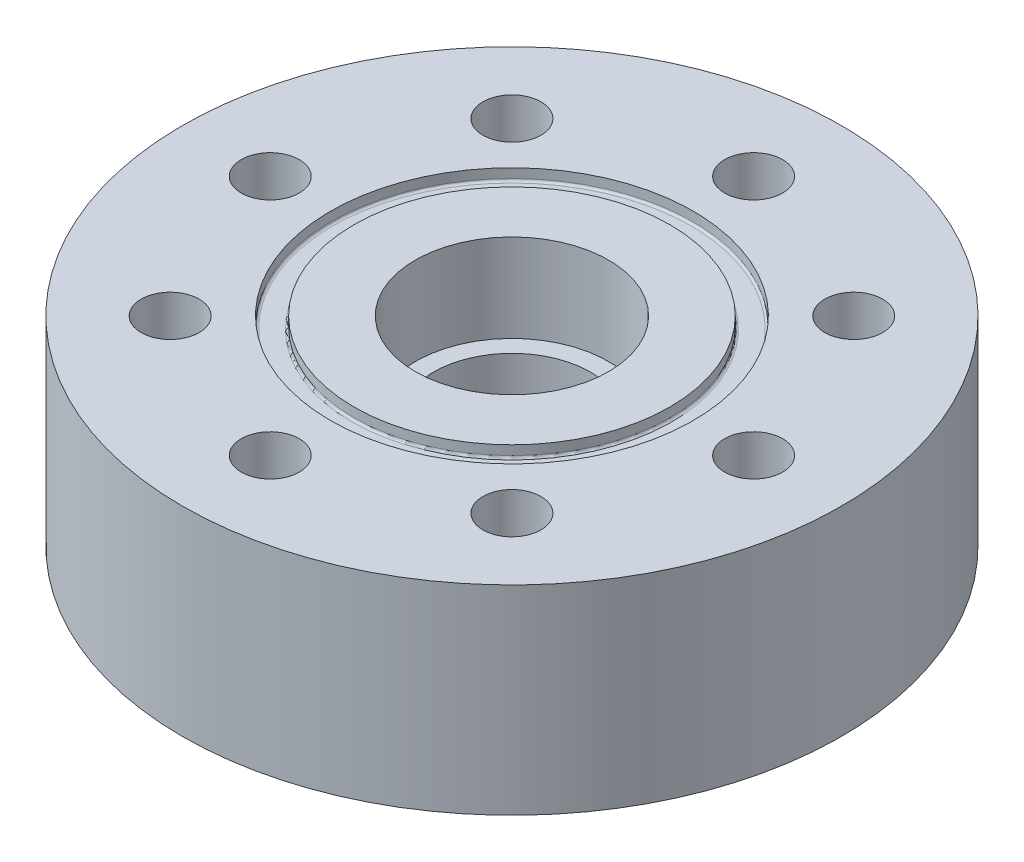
ISO-10303-21;
HEADER;
FILE_DESCRIPTION(('STEP AP214'),'2;1');
FILE_NAME('part.step','',(''),(''),'','','');
FILE_SCHEMA(('AUTOMOTIVE_DESIGN { 1 0 10303 214 1 1 1 1 }'));
ENDSEC;
DATA;
#1=APPLICATION_CONTEXT('core data for automotive mechanical design processes');
#2=APPLICATION_PROTOCOL_DEFINITION('international standard','automotive_design',2000,#1);
#3=PRODUCT_CONTEXT('',#1,'mechanical');
#4=PRODUCT('Part','Part','',(#3));
#5=PRODUCT_RELATED_PRODUCT_CATEGORY('part','',(#4));
#6=PRODUCT_DEFINITION_FORMATION('','',#4);
#7=PRODUCT_DEFINITION_CONTEXT('part definition',#1,'design');
#8=PRODUCT_DEFINITION('design','',#6,#7);
#9=PRODUCT_DEFINITION_SHAPE('','',#8);
#10=(LENGTH_UNIT() NAMED_UNIT(*) SI_UNIT(.MILLI.,.METRE.));
#11=(NAMED_UNIT(*) PLANE_ANGLE_UNIT() SI_UNIT($,.RADIAN.));
#12=(NAMED_UNIT(*) SI_UNIT($,.STERADIAN.) SOLID_ANGLE_UNIT());
#13=UNCERTAINTY_MEASURE_WITH_UNIT(LENGTH_MEASURE(1.E-05),#10,'distance_accuracy_value','');
#14=(GEOMETRIC_REPRESENTATION_CONTEXT(3) GLOBAL_UNCERTAINTY_ASSIGNED_CONTEXT((#13)) GLOBAL_UNIT_ASSIGNED_CONTEXT((#10,
#11,#12)) REPRESENTATION_CONTEXT('',''));
#15=CARTESIAN_POINT('',(0.,0.,0.));
#16=DIRECTION('',(0.,0.,1.));
#17=DIRECTION('',(1.,0.,0.));
#18=AXIS2_PLACEMENT_3D('',#15,#16,#17);
#19=CARTESIAN_POINT('',(0.,22.7,0.));
#20=DIRECTION('',(0.,-1.,0.));
#21=DIRECTION('',(0.,0.,-1.));
#22=AXIS2_PLACEMENT_3D('',#19,#20,#21);
#23=CYLINDRICAL_SURFACE('',#22,37.5);
#24=CARTESIAN_POINT('',(0.,22.7,0.));
#25=DIRECTION('',(0.,1.,0.));
#26=DIRECTION('',(0.,0.,1.));
#27=AXIS2_PLACEMENT_3D('',#24,#25,#26);
#28=CIRCLE('',#27,37.5);
#29=CARTESIAN_POINT('',(0.,22.7,37.5));
#30=VERTEX_POINT('',#29);
#31=EDGE_CURVE('E54',#30,#30,#28,.T.);
#32=ORIENTED_EDGE('',*,*,#31,.F.);
#33=EDGE_LOOP('',(#32));
#34=FACE_BOUND('',#33,.T.);
#35=CARTESIAN_POINT('',(0.,0.,0.));
#36=DIRECTION('',(0.,1.,0.));
#37=DIRECTION('',(0.,0.,1.));
#38=AXIS2_PLACEMENT_3D('',#35,#36,#37);
#39=CIRCLE('',#38,37.5);
#40=CARTESIAN_POINT('',(0.,0.,37.5));
#41=VERTEX_POINT('',#40);
#42=EDGE_CURVE('E55',#41,#41,#39,.T.);
#43=ORIENTED_EDGE('',*,*,#42,.T.);
#44=EDGE_LOOP('',(#43));
#45=FACE_BOUND('',#44,.T.);
#46=ADVANCED_FACE('F34',(#34,#45),#23,.T.);
#47=CARTESIAN_POINT('',(0.,22.7,0.));
#48=DIRECTION('',(0.,1.,0.));
#49=DIRECTION('',(0.,0.,1.));
#50=AXIS2_PLACEMENT_3D('',#47,#48,#49);
#51=PLANE('',#50);
#52=CARTESIAN_POINT('',(0.,22.7,0.));
#53=DIRECTION('',(0.,1.,0.));
#54=DIRECTION('',(0.,0.,1.));
#55=AXIS2_PLACEMENT_3D('',#52,#53,#54);
#56=CIRCLE('',#55,20.6375);
#57=CARTESIAN_POINT('',(0.,22.7,20.6375));
#58=VERTEX_POINT('',#57);
#59=EDGE_CURVE('E73',#58,#58,#56,.T.);
#60=ORIENTED_EDGE('',*,*,#59,.F.);
#61=EDGE_LOOP('',(#60));
#62=FACE_BOUND('',#61,.T.);
#63=CARTESIAN_POINT('',(-27.5,22.7,0.));
#64=DIRECTION('',(0.,-1.,0.));
#65=DIRECTION('',(0.,0.,-1.));
#66=AXIS2_PLACEMENT_3D('',#63,#64,#65);
#67=CIRCLE('',#66,3.3);
#68=CARTESIAN_POINT('',(-27.5,22.7,-3.3));
#69=VERTEX_POINT('',#68);
#70=EDGE_CURVE('E63',#69,#69,#67,.T.);
#71=ORIENTED_EDGE('',*,*,#70,.T.);
#72=EDGE_LOOP('',(#71));
#73=FACE_BOUND('',#72,.T.);
#74=CARTESIAN_POINT('',(-19.44543648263,22.7,19.4454364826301));
#75=DIRECTION('',(0.,-1.,0.));
#76=DIRECTION('',(0.,0.,-1.));
#77=AXIS2_PLACEMENT_3D('',#74,#75,#76);
#78=CIRCLE('',#77,3.30000000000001);
#79=CARTESIAN_POINT('',(-19.44543648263,22.7,16.1454364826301));
#80=VERTEX_POINT('',#79);
#81=EDGE_CURVE('E109',#80,#80,#78,.T.);
#82=ORIENTED_EDGE('',*,*,#81,.T.);
#83=EDGE_LOOP('',(#82));
#84=FACE_BOUND('',#83,.T.);
#85=CARTESIAN_POINT('',(0.,22.7,27.5));
#86=DIRECTION('',(0.,-1.,0.));
#87=DIRECTION('',(0.,0.,-1.));
#88=AXIS2_PLACEMENT_3D('',#85,#86,#87);
#89=CIRCLE('',#88,3.3);
#90=CARTESIAN_POINT('',(0.,22.7,24.2));
#91=VERTEX_POINT('',#90);
#92=EDGE_CURVE('E103',#91,#91,#89,.T.);
#93=ORIENTED_EDGE('',*,*,#92,.T.);
#94=EDGE_LOOP('',(#93));
#95=FACE_BOUND('',#94,.T.);
#96=CARTESIAN_POINT('',(19.4454364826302,22.7,19.44543648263));
#97=DIRECTION('',(0.,-1.,0.));
#98=DIRECTION('',(0.,0.,-1.));
#99=AXIS2_PLACEMENT_3D('',#96,#97,#98);
#100=CIRCLE('',#99,3.3);
#101=CARTESIAN_POINT('',(19.4454364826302,22.7,16.14543648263));
#102=VERTEX_POINT('',#101);
#103=EDGE_CURVE('E97',#102,#102,#100,.T.);
#104=ORIENTED_EDGE('',*,*,#103,.T.);
#105=EDGE_LOOP('',(#104));
#106=FACE_BOUND('',#105,.T.);
#107=CARTESIAN_POINT('',(27.5,22.7,-1.92031473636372E-13));
#108=DIRECTION('',(0.,-1.,0.));
#109=DIRECTION('',(0.,0.,-1.));
#110=AXIS2_PLACEMENT_3D('',#107,#108,#109);
#111=CIRCLE('',#110,3.3);
#112=CARTESIAN_POINT('',(27.5,22.7,-3.30000000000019));
#113=VERTEX_POINT('',#112);
#114=EDGE_CURVE('E91',#113,#113,#111,.T.);
#115=ORIENTED_EDGE('',*,*,#114,.T.);
#116=EDGE_LOOP('',(#115));
#117=FACE_BOUND('',#116,.T.);
#118=CARTESIAN_POINT('',(19.4454364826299,22.7,-19.4454364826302));
#119=DIRECTION('',(0.,-1.,0.));
#120=DIRECTION('',(0.,0.,-1.));
#121=AXIS2_PLACEMENT_3D('',#118,#119,#120);
#122=CIRCLE('',#121,3.3);
#123=CARTESIAN_POINT('',(19.4454364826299,22.7,-22.7454364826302));
#124=VERTEX_POINT('',#123);
#125=EDGE_CURVE('E85',#124,#124,#122,.T.);
#126=ORIENTED_EDGE('',*,*,#125,.T.);
#127=EDGE_LOOP('',(#126));
#128=FACE_BOUND('',#127,.T.);
#129=CARTESIAN_POINT('',(-2.88047210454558E-13,22.7,-27.5));
#130=DIRECTION('',(0.,-1.,0.));
#131=DIRECTION('',(0.,0.,-1.));
#132=AXIS2_PLACEMENT_3D('',#129,#130,#131);
#133=CIRCLE('',#132,3.3);
#134=CARTESIAN_POINT('',(-2.88047210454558E-13,22.7,-30.8));
#135=VERTEX_POINT('',#134);
#136=EDGE_CURVE('E79',#135,#135,#133,.T.);
#137=ORIENTED_EDGE('',*,*,#136,.T.);
#138=EDGE_LOOP('',(#137));
#139=FACE_BOUND('',#138,.T.);
#140=CARTESIAN_POINT('',(-19.4454364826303,22.7,-19.4454364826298));
#141=DIRECTION('',(0.,-1.,0.));
#142=DIRECTION('',(0.,0.,-1.));
#143=AXIS2_PLACEMENT_3D('',#140,#141,#142);
#144=CIRCLE('',#143,3.3);
#145=CARTESIAN_POINT('',(-19.4454364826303,22.7,-22.7454364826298));
#146=VERTEX_POINT('',#145);
#147=EDGE_CURVE('E72',#146,#146,#144,.T.);
#148=ORIENTED_EDGE('',*,*,#147,.T.);
#149=EDGE_LOOP('',(#148));
#150=FACE_BOUND('',#149,.T.);
#151=ORIENTED_EDGE('',*,*,#31,.T.);
#152=EDGE_LOOP('',(#151));
#153=FACE_BOUND('',#152,.T.);
#154=ADVANCED_FACE('F142',(#62,#73,#84,#95,#106,#117,#128,#139,#150,#153),#51,.T.);
#155=CARTESIAN_POINT('',(0.,0.,0.));
#156=DIRECTION('',(0.,1.,0.));
#157=DIRECTION('',(0.,0.,1.));
#158=AXIS2_PLACEMENT_3D('',#155,#156,#157);
#159=PLANE('',#158);
#160=CARTESIAN_POINT('',(-27.5,0.,0.));
#161=DIRECTION('',(0.,-1.,0.));
#162=DIRECTION('',(0.,0.,-1.));
#163=AXIS2_PLACEMENT_3D('',#160,#161,#162);
#164=CIRCLE('',#163,3.3);
#165=CARTESIAN_POINT('',(-27.5,0.,-3.3));
#166=VERTEX_POINT('',#165);
#167=EDGE_CURVE('E112',#166,#166,#164,.T.);
#168=ORIENTED_EDGE('',*,*,#167,.F.);
#169=EDGE_LOOP('',(#168));
#170=FACE_BOUND('',#169,.T.);
#171=CARTESIAN_POINT('',(-19.44543648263,0.,19.4454364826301));
#172=DIRECTION('',(0.,-1.,0.));
#173=DIRECTION('',(0.,0.,-1.));
#174=AXIS2_PLACEMENT_3D('',#171,#172,#173);
#175=CIRCLE('',#174,3.30000000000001);
#176=CARTESIAN_POINT('',(-19.44543648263,0.,16.1454364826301));
#177=VERTEX_POINT('',#176);
#178=EDGE_CURVE('E106',#177,#177,#175,.T.);
#179=ORIENTED_EDGE('',*,*,#178,.F.);
#180=EDGE_LOOP('',(#179));
#181=FACE_BOUND('',#180,.T.);
#182=CARTESIAN_POINT('',(0.,0.,27.5));
#183=DIRECTION('',(0.,-1.,0.));
#184=DIRECTION('',(0.,0.,-1.));
#185=AXIS2_PLACEMENT_3D('',#182,#183,#184);
#186=CIRCLE('',#185,3.3);
#187=CARTESIAN_POINT('',(0.,0.,24.2));
#188=VERTEX_POINT('',#187);
#189=EDGE_CURVE('E100',#188,#188,#186,.T.);
#190=ORIENTED_EDGE('',*,*,#189,.F.);
#191=EDGE_LOOP('',(#190));
#192=FACE_BOUND('',#191,.T.);
#193=CARTESIAN_POINT('',(19.4454364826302,0.,19.44543648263));
#194=DIRECTION('',(0.,-1.,0.));
#195=DIRECTION('',(0.,0.,-1.));
#196=AXIS2_PLACEMENT_3D('',#193,#194,#195);
#197=CIRCLE('',#196,3.3);
#198=CARTESIAN_POINT('',(19.4454364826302,0.,16.14543648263));
#199=VERTEX_POINT('',#198);
#200=EDGE_CURVE('E94',#199,#199,#197,.T.);
#201=ORIENTED_EDGE('',*,*,#200,.F.);
#202=EDGE_LOOP('',(#201));
#203=FACE_BOUND('',#202,.T.);
#204=CARTESIAN_POINT('',(27.5,0.,-1.92031473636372E-13));
#205=DIRECTION('',(0.,-1.,0.));
#206=DIRECTION('',(0.,0.,-1.));
#207=AXIS2_PLACEMENT_3D('',#204,#205,#206);
#208=CIRCLE('',#207,3.3);
#209=CARTESIAN_POINT('',(27.5,0.,-3.30000000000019));
#210=VERTEX_POINT('',#209);
#211=EDGE_CURVE('E88',#210,#210,#208,.T.);
#212=ORIENTED_EDGE('',*,*,#211,.F.);
#213=EDGE_LOOP('',(#212));
#214=FACE_BOUND('',#213,.T.);
#215=CARTESIAN_POINT('',(19.4454364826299,0.,-19.4454364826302));
#216=DIRECTION('',(0.,-1.,0.));
#217=DIRECTION('',(0.,0.,-1.));
#218=AXIS2_PLACEMENT_3D('',#215,#216,#217);
#219=CIRCLE('',#218,3.3);
#220=CARTESIAN_POINT('',(19.4454364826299,0.,-22.7454364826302));
#221=VERTEX_POINT('',#220);
#222=EDGE_CURVE('E82',#221,#221,#219,.T.);
#223=ORIENTED_EDGE('',*,*,#222,.F.);
#224=EDGE_LOOP('',(#223));
#225=FACE_BOUND('',#224,.T.);
#226=CARTESIAN_POINT('',(-2.88047210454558E-13,0.,-27.5));
#227=DIRECTION('',(0.,-1.,0.));
#228=DIRECTION('',(0.,0.,-1.));
#229=AXIS2_PLACEMENT_3D('',#226,#227,#228);
#230=CIRCLE('',#229,3.3);
#231=CARTESIAN_POINT('',(-2.88047210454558E-13,0.,-30.8));
#232=VERTEX_POINT('',#231);
#233=EDGE_CURVE('E76',#232,#232,#230,.T.);
#234=ORIENTED_EDGE('',*,*,#233,.F.);
#235=EDGE_LOOP('',(#234));
#236=FACE_BOUND('',#235,.T.);
#237=CARTESIAN_POINT('',(-19.4454364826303,0.,-19.4454364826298));
#238=DIRECTION('',(0.,-1.,0.));
#239=DIRECTION('',(0.,0.,-1.));
#240=AXIS2_PLACEMENT_3D('',#237,#238,#239);
#241=CIRCLE('',#240,3.3);
#242=CARTESIAN_POINT('',(-19.4454364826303,0.,-22.7454364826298));
#243=VERTEX_POINT('',#242);
#244=EDGE_CURVE('E69',#243,#243,#241,.T.);
#245=ORIENTED_EDGE('',*,*,#244,.F.);
#246=EDGE_LOOP('',(#245));
#247=FACE_BOUND('',#246,.T.);
#248=CARTESIAN_POINT('',(0.,0.,0.));
#249=DIRECTION('',(0.,-1.,0.));
#250=DIRECTION('',(0.,0.,-1.));
#251=AXIS2_PLACEMENT_3D('',#248,#249,#250);
#252=CIRCLE('',#251,8.93);
#253=CARTESIAN_POINT('',(0.,0.,-8.93));
#254=VERTEX_POINT('',#253);
#255=EDGE_CURVE('E58',#254,#254,#252,.T.);
#256=ORIENTED_EDGE('',*,*,#255,.F.);
#257=EDGE_LOOP('',(#256));
#258=FACE_BOUND('',#257,.T.);
#259=ORIENTED_EDGE('',*,*,#42,.F.);
#260=EDGE_LOOP('',(#259));
#261=FACE_BOUND('',#260,.T.);
#262=ADVANCED_FACE('F162',(#170,#181,#192,#203,#214,#225,#236,#247,#258,#261),#159,.F.);
#263=CARTESIAN_POINT('',(0.,12.7,0.));
#264=DIRECTION('',(0.,-1.,0.));
#265=DIRECTION('',(0.,0.,-1.));
#266=AXIS2_PLACEMENT_3D('',#263,#264,#265);
#267=CYLINDRICAL_SURFACE('',#266,8.93);
#268=CARTESIAN_POINT('',(0.,12.7,0.));
#269=DIRECTION('',(0.,-1.,0.));
#270=DIRECTION('',(0.,0.,-1.));
#271=AXIS2_PLACEMENT_3D('',#268,#269,#270);
#272=CIRCLE('',#271,8.93);
#273=CARTESIAN_POINT('',(0.,12.7,-8.93));
#274=VERTEX_POINT('',#273);
#275=EDGE_CURVE('E64',#274,#274,#272,.T.);
#276=ORIENTED_EDGE('',*,*,#275,.F.);
#277=EDGE_LOOP('',(#276));
#278=FACE_BOUND('',#277,.T.);
#279=ORIENTED_EDGE('',*,*,#255,.T.);
#280=EDGE_LOOP('',(#279));
#281=FACE_BOUND('',#280,.T.);
#282=ADVANCED_FACE('F293',(#278,#281),#267,.F.);
#283=CARTESIAN_POINT('',(-19.4454364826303,22.7,-19.4454364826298));
#284=DIRECTION('',(0.,-1.,0.));
#285=DIRECTION('',(0.,0.,-1.));
#286=AXIS2_PLACEMENT_3D('',#283,#284,#285);
#287=CYLINDRICAL_SURFACE('',#286,3.3);
#288=ORIENTED_EDGE('',*,*,#147,.F.);
#289=EDGE_LOOP('',(#288));
#290=FACE_BOUND('',#289,.T.);
#291=ORIENTED_EDGE('',*,*,#244,.T.);
#292=EDGE_LOOP('',(#291));
#293=FACE_BOUND('',#292,.T.);
#294=ADVANCED_FACE('F284',(#290,#293),#287,.F.);
#295=CARTESIAN_POINT('',(-2.88047210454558E-13,22.7,-27.5));
#296=DIRECTION('',(0.,-1.,0.));
#297=DIRECTION('',(0.,0.,-1.));
#298=AXIS2_PLACEMENT_3D('',#295,#296,#297);
#299=CYLINDRICAL_SURFACE('',#298,3.3);
#300=ORIENTED_EDGE('',*,*,#136,.F.);
#301=EDGE_LOOP('',(#300));
#302=FACE_BOUND('',#301,.T.);
#303=ORIENTED_EDGE('',*,*,#233,.T.);
#304=EDGE_LOOP('',(#303));
#305=FACE_BOUND('',#304,.T.);
#306=ADVANCED_FACE('F275',(#302,#305),#299,.F.);
#307=CARTESIAN_POINT('',(19.4454364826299,22.7,-19.4454364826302));
#308=DIRECTION('',(0.,-1.,0.));
#309=DIRECTION('',(0.,0.,-1.));
#310=AXIS2_PLACEMENT_3D('',#307,#308,#309);
#311=CYLINDRICAL_SURFACE('',#310,3.3);
#312=ORIENTED_EDGE('',*,*,#125,.F.);
#313=EDGE_LOOP('',(#312));
#314=FACE_BOUND('',#313,.T.);
#315=ORIENTED_EDGE('',*,*,#222,.T.);
#316=EDGE_LOOP('',(#315));
#317=FACE_BOUND('',#316,.T.);
#318=ADVANCED_FACE('F266',(#314,#317),#311,.F.);
#319=CARTESIAN_POINT('',(27.5,22.7,-1.92031473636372E-13));
#320=DIRECTION('',(0.,-1.,0.));
#321=DIRECTION('',(0.,0.,-1.));
#322=AXIS2_PLACEMENT_3D('',#319,#320,#321);
#323=CYLINDRICAL_SURFACE('',#322,3.3);
#324=ORIENTED_EDGE('',*,*,#114,.F.);
#325=EDGE_LOOP('',(#324));
#326=FACE_BOUND('',#325,.T.);
#327=ORIENTED_EDGE('',*,*,#211,.T.);
#328=EDGE_LOOP('',(#327));
#329=FACE_BOUND('',#328,.T.);
#330=ADVANCED_FACE('F257',(#326,#329),#323,.F.);
#331=CARTESIAN_POINT('',(19.4454364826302,22.7,19.44543648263));
#332=DIRECTION('',(0.,-1.,0.));
#333=DIRECTION('',(0.,0.,-1.));
#334=AXIS2_PLACEMENT_3D('',#331,#332,#333);
#335=CYLINDRICAL_SURFACE('',#334,3.3);
#336=ORIENTED_EDGE('',*,*,#103,.F.);
#337=EDGE_LOOP('',(#336));
#338=FACE_BOUND('',#337,.T.);
#339=ORIENTED_EDGE('',*,*,#200,.T.);
#340=EDGE_LOOP('',(#339));
#341=FACE_BOUND('',#340,.T.);
#342=ADVANCED_FACE('F248',(#338,#341),#335,.F.);
#343=CARTESIAN_POINT('',(0.,22.7,27.5));
#344=DIRECTION('',(0.,-1.,0.));
#345=DIRECTION('',(0.,0.,-1.));
#346=AXIS2_PLACEMENT_3D('',#343,#344,#345);
#347=CYLINDRICAL_SURFACE('',#346,3.3);
#348=ORIENTED_EDGE('',*,*,#92,.F.);
#349=EDGE_LOOP('',(#348));
#350=FACE_BOUND('',#349,.T.);
#351=ORIENTED_EDGE('',*,*,#189,.T.);
#352=EDGE_LOOP('',(#351));
#353=FACE_BOUND('',#352,.T.);
#354=ADVANCED_FACE('F239',(#350,#353),#347,.F.);
#355=CARTESIAN_POINT('',(-19.44543648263,22.7,19.4454364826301));
#356=DIRECTION('',(0.,-1.,0.));
#357=DIRECTION('',(0.,0.,-1.));
#358=AXIS2_PLACEMENT_3D('',#355,#356,#357);
#359=CYLINDRICAL_SURFACE('',#358,3.30000000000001);
#360=ORIENTED_EDGE('',*,*,#81,.F.);
#361=EDGE_LOOP('',(#360));
#362=FACE_BOUND('',#361,.T.);
#363=ORIENTED_EDGE('',*,*,#178,.T.);
#364=EDGE_LOOP('',(#363));
#365=FACE_BOUND('',#364,.T.);
#366=ADVANCED_FACE('F230',(#362,#365),#359,.F.);
#367=CARTESIAN_POINT('',(-27.5,22.7,0.));
#368=DIRECTION('',(0.,-1.,0.));
#369=DIRECTION('',(0.,0.,-1.));
#370=AXIS2_PLACEMENT_3D('',#367,#368,#369);
#371=CYLINDRICAL_SURFACE('',#370,3.3);
#372=ORIENTED_EDGE('',*,*,#70,.F.);
#373=EDGE_LOOP('',(#372));
#374=FACE_BOUND('',#373,.T.);
#375=ORIENTED_EDGE('',*,*,#167,.T.);
#376=EDGE_LOOP('',(#375));
#377=FACE_BOUND('',#376,.T.);
#378=ADVANCED_FACE('F216',(#374,#377),#371,.F.);
#379=CARTESIAN_POINT('',(0.,21.3792,0.));
#380=DIRECTION('',(0.,1.,0.));
#381=DIRECTION('',(0.,0.,1.));
#382=AXIS2_PLACEMENT_3D('',#379,#380,#381);
#383=CYLINDRICAL_SURFACE('',#382,20.6375);
#384=CARTESIAN_POINT('',(0.,21.6332,0.));
#385=DIRECTION('',(0.,1.,0.));
#386=DIRECTION('',(0.,0.,1.));
#387=AXIS2_PLACEMENT_3D('',#384,#385,#386);
#388=CIRCLE('',#387,20.6375);
#389=CARTESIAN_POINT('',(0.,21.6332,20.6375));
#390=VERTEX_POINT('',#389);
#391=EDGE_CURVE('E10',#390,#390,#388,.F.);
#392=ORIENTED_EDGE('',*,*,#391,.T.);
#393=EDGE_LOOP('',(#392));
#394=FACE_BOUND('',#393,.T.);
#395=ORIENTED_EDGE('',*,*,#59,.T.);
#396=EDGE_LOOP('',(#395));
#397=FACE_BOUND('',#396,.T.);
#398=ADVANCED_FACE('F153',(#394,#397),#383,.F.);
#399=CARTESIAN_POINT('',(0.,21.3792,0.));
#400=DIRECTION('',(0.,1.,0.));
#401=DIRECTION('',(0.,0.,1.));
#402=AXIS2_PLACEMENT_3D('',#399,#400,#401);
#403=PLANE('',#402);
#404=CARTESIAN_POINT('',(0.,21.3792,0.));
#405=DIRECTION('',(0.,1.,0.));
#406=DIRECTION('',(0.,0.,1.));
#407=AXIS2_PLACEMENT_3D('',#404,#405,#406);
#408=CIRCLE('',#407,18.2245);
#409=CARTESIAN_POINT('',(0.,21.3792,18.2245));
#410=VERTEX_POINT('',#409);
#411=EDGE_CURVE('E41',#410,#410,#408,.F.);
#412=ORIENTED_EDGE('',*,*,#411,.T.);
#413=EDGE_LOOP('',(#412));
#414=FACE_BOUND('',#413,.T.);
#415=CARTESIAN_POINT('',(0.,21.3792,0.));
#416=DIRECTION('',(0.,1.,0.));
#417=DIRECTION('',(0.,0.,1.));
#418=AXIS2_PLACEMENT_3D('',#415,#416,#417);
#419=CIRCLE('',#418,20.3835);
#420=CARTESIAN_POINT('',(0.,21.3792,20.3835));
#421=VERTEX_POINT('',#420);
#422=EDGE_CURVE('E45',#421,#421,#419,.T.);
#423=ORIENTED_EDGE('',*,*,#422,.T.);
#424=EDGE_LOOP('',(#423));
#425=FACE_BOUND('',#424,.T.);
#426=ADVANCED_FACE('F146',(#414,#425),#403,.T.);
#427=CARTESIAN_POINT('',(0.,21.3792,0.));
#428=DIRECTION('',(0.,1.,0.));
#429=DIRECTION('',(0.,0.,1.));
#430=AXIS2_PLACEMENT_3D('',#427,#428,#429);
#431=CYLINDRICAL_SURFACE('',#430,17.9705);
#432=CARTESIAN_POINT('',(0.,21.6332,0.));
#433=DIRECTION('',(0.,1.,0.));
#434=DIRECTION('',(0.,0.,1.));
#435=AXIS2_PLACEMENT_3D('',#432,#433,#434);
#436=CIRCLE('',#435,17.9705);
#437=CARTESIAN_POINT('',(0.,21.6332,17.9705));
#438=VERTEX_POINT('',#437);
#439=EDGE_CURVE('E49',#438,#438,#436,.T.);
#440=ORIENTED_EDGE('',*,*,#439,.T.);
#441=EDGE_LOOP('',(#440));
#442=FACE_BOUND('',#441,.T.);
#443=CARTESIAN_POINT('',(0.,22.7,0.));
#444=DIRECTION('',(0.,1.,0.));
#445=DIRECTION('',(0.,0.,1.));
#446=AXIS2_PLACEMENT_3D('',#443,#444,#445);
#447=CIRCLE('',#446,17.9705);
#448=CARTESIAN_POINT('',(0.,22.7,17.9705));
#449=VERTEX_POINT('',#448);
#450=EDGE_CURVE('E67',#449,#449,#447,.T.);
#451=ORIENTED_EDGE('',*,*,#450,.F.);
#452=EDGE_LOOP('',(#451));
#453=FACE_BOUND('',#452,.T.);
#454=ADVANCED_FACE('F140',(#442,#453),#431,.T.);
#455=CARTESIAN_POINT('',(0.,22.7,0.));
#456=DIRECTION('',(0.,1.,0.));
#457=DIRECTION('',(0.,0.,1.));
#458=AXIS2_PLACEMENT_3D('',#455,#456,#457);
#459=CIRCLE('',#458,11.);
#460=CARTESIAN_POINT('',(0.,22.7,11.));
#461=VERTEX_POINT('',#460);
#462=EDGE_CURVE('E121',#461,#461,#459,.T.);
#463=ORIENTED_EDGE('',*,*,#462,.F.);
#464=EDGE_LOOP('',(#463));
#465=FACE_BOUND('',#464,.T.);
#466=ORIENTED_EDGE('',*,*,#450,.T.);
#467=EDGE_LOOP('',(#466));
#468=FACE_BOUND('',#467,.T.);
#469=ADVANCED_FACE('F136',(#465,#468),#51,.T.);
#470=CARTESIAN_POINT('',(0.,21.6332,0.));
#471=DIRECTION('',(0.,1.,0.));
#472=DIRECTION('',(0.,0.,1.));
#473=AXIS2_PLACEMENT_3D('',#470,#471,#472);
#474=TOROIDAL_SURFACE('',#473,18.2245,0.254);
#475=ORIENTED_EDGE('',*,*,#411,.F.);
#476=EDGE_LOOP('',(#475));
#477=FACE_BOUND('',#476,.T.);
#478=ORIENTED_EDGE('',*,*,#439,.F.);
#479=EDGE_LOOP('',(#478));
#480=FACE_BOUND('',#479,.T.);
#481=ADVANCED_FACE('F139',(#477,#480),#474,.F.);
#482=CARTESIAN_POINT('',(0.,21.6332,0.));
#483=DIRECTION('',(0.,1.,0.));
#484=DIRECTION('',(0.,0.,1.));
#485=AXIS2_PLACEMENT_3D('',#482,#483,#484);
#486=TOROIDAL_SURFACE('',#485,20.3835,0.254);
#487=ORIENTED_EDGE('',*,*,#391,.F.);
#488=EDGE_LOOP('',(#487));
#489=FACE_BOUND('',#488,.T.);
#490=ORIENTED_EDGE('',*,*,#422,.F.);
#491=EDGE_LOOP('',(#490));
#492=FACE_BOUND('',#491,.T.);
#493=ADVANCED_FACE('F36',(#489,#492),#486,.F.);
#494=CARTESIAN_POINT('',(0.,12.7,0.));
#495=DIRECTION('',(0.,1.,0.));
#496=DIRECTION('',(0.,0.,1.));
#497=AXIS2_PLACEMENT_3D('',#494,#495,#496);
#498=PLANE('',#497);
#499=CARTESIAN_POINT('',(0.,12.7,0.));
#500=DIRECTION('',(0.,1.,0.));
#501=DIRECTION('',(0.,0.,1.));
#502=AXIS2_PLACEMENT_3D('',#499,#500,#501);
#503=CIRCLE('',#502,11.);
#504=CARTESIAN_POINT('',(0.,12.7,11.));
#505=VERTEX_POINT('',#504);
#506=EDGE_CURVE('E68',#505,#505,#503,.T.);
#507=ORIENTED_EDGE('',*,*,#506,.T.);
#508=EDGE_LOOP('',(#507));
#509=FACE_BOUND('',#508,.T.);
#510=ORIENTED_EDGE('',*,*,#275,.T.);
#511=EDGE_LOOP('',(#510));
#512=FACE_BOUND('',#511,.T.);
#513=ADVANCED_FACE('F127',(#509,#512),#498,.T.);
#514=CARTESIAN_POINT('',(0.,12.7,0.));
#515=DIRECTION('',(0.,1.,0.));
#516=DIRECTION('',(0.,0.,1.));
#517=AXIS2_PLACEMENT_3D('',#514,#515,#516);
#518=CYLINDRICAL_SURFACE('',#517,11.);
#519=ORIENTED_EDGE('',*,*,#506,.F.);
#520=EDGE_LOOP('',(#519));
#521=FACE_BOUND('',#520,.T.);
#522=ORIENTED_EDGE('',*,*,#462,.T.);
#523=EDGE_LOOP('',(#522));
#524=FACE_BOUND('',#523,.T.);
#525=ADVANCED_FACE('F130',(#521,#524),#518,.F.);
#526=CLOSED_SHELL('',(#46,#154,#262,#282,#294,#306,#318,#330,#342,#354,#366,#378,#398,#426,#454,
#469,#481,#493,#513,#525));
#527=MANIFOLD_SOLID_BREP('B2',#526);
#528=ADVANCED_BREP_SHAPE_REPRESENTATION('',(#18,#527),#14);
#529=SHAPE_DEFINITION_REPRESENTATION(#9,#528);
ENDSEC;
END-ISO-10303-21;
